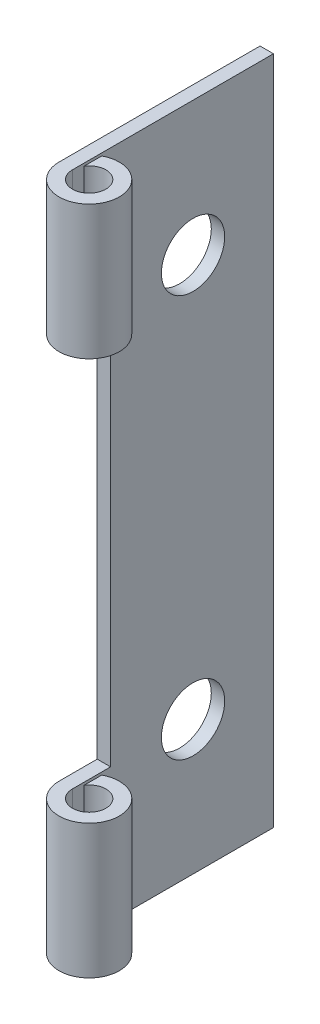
from build123d import *

# Parameters (mm, degrees)
BOSS_EXTRUDE1_DEPTH = 31.75
SKETCH7_W           = 3.6195
SKETCH7_H           = 6.35
CUT_EXTRUDE2_DEPTH  = 34.270909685
SKETCH10_W          = 3.6195
SKETCH10_H          = 6.35
CUT_EXTRUDE4_DEPTH  = 34.270909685
SKETCH15_R          = 1.5
CUT_EXTRUDE5_DEPTH  = 34.222396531


with BuildPart() as part:
    # Sketch3 → Boss-Extrude1 (new body)
    with BuildSketch(Plane(origin=(0, 0, 0), x_dir=(1, 0, 0), z_dir=(0, 1, 0))):
        with BuildLine():
            Line((0.635, 9.525), (0, 9.525))
            Line((0, 9.525), (0, 0))
            ThreePointArc((0, 0), (2.652258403, -0.737803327), (0.762, 1.263634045))
            Line((0.762, 1.263634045), (0.762, 0.430677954))
            ThreePointArc((0.762, 0.430677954), (2.190088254, -0.224506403), (0.635, 0))
            Line((0.635, 0), (0.635, 9.525))
        make_face()
    extrude(amount=BOSS_EXTRUDE1_DEPTH)

    # Sketch7 → Cut-Extrude2 (cut, through all)
    with BuildSketch(Plane(origin=(0, 0, 0), x_dir=(0, 0, -1), z_dir=(1, 0, 0))):
        with Locations((0, 34.925)):
            Rectangle(SKETCH7_W, SKETCH7_H)
        with Locations((0, 9.525)):
            Rectangle(SKETCH7_W, SKETCH7_H)
        with Locations((0, 22.225)):
            Rectangle(SKETCH7_W, SKETCH7_H)
    extrude(amount=CUT_EXTRUDE2_DEPTH, mode=Mode.SUBTRACT)

    # Sketch10 → Cut-Extrude4 (cut, through all)
    with BuildSketch(Plane(origin=(0, 0, 0), x_dir=(0, 0, -1), z_dir=(1, 0, 0))):
        with Locations((0, 15.875)):
            Rectangle(SKETCH10_W, SKETCH10_H)
    extrude(amount=CUT_EXTRUDE4_DEPTH, mode=Mode.SUBTRACT)

    # Sketch15 → Cut-Extrude5 (cut, through all)
    with BuildSketch(Plane(origin=(0.635, 0, 0), x_dir=(0, 0, -1), z_dir=(1, 0, 0))):
        with Locations((5.715, 6.35)):
            Circle(SKETCH15_R)
        with Locations((5.715, 25.4)):
            Circle(SKETCH15_R)
    extrude(amount=-CUT_EXTRUDE5_DEPTH, mode=Mode.SUBTRACT)


solid = part.part
